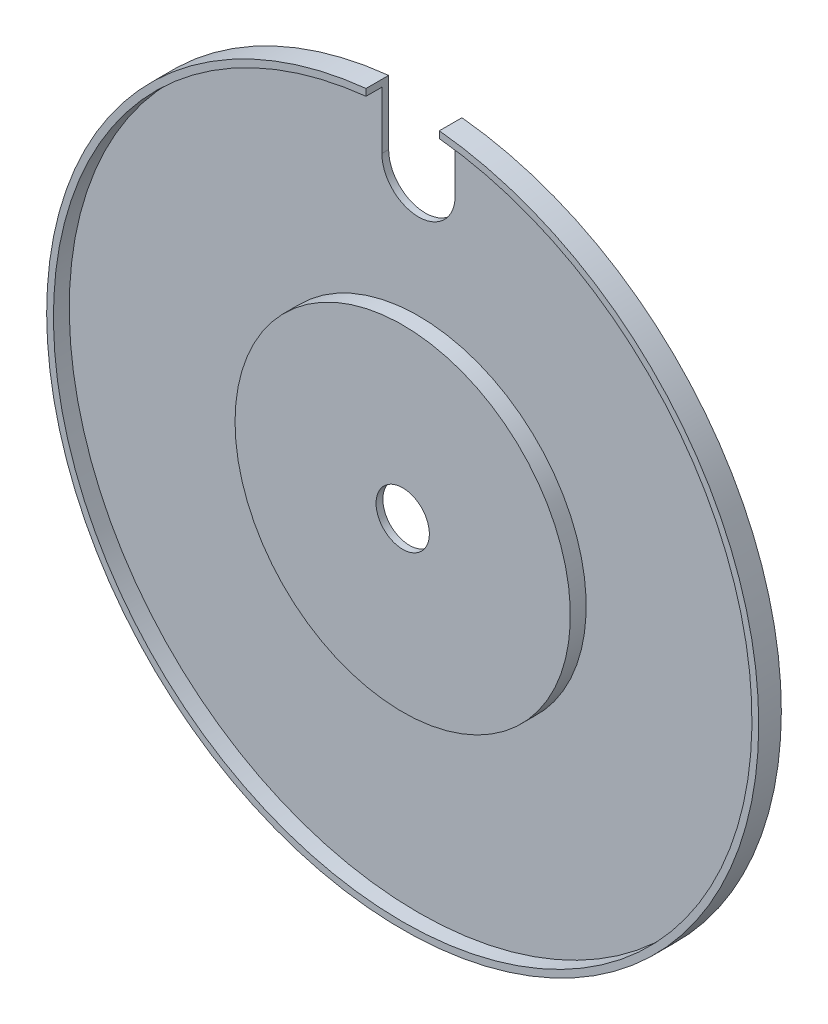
from build123d import *

# Parameters (mm, degrees)
SHELL1_T           = -0.762
SKETCH1_R          = 2.992510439
CUT_EXTRUDE5_DEPTH = 6.858


with BuildPart() as part:
    # Sketch2 → Revolve2 (revolve)
    with BuildSketch(Plane(origin=(0, 0, 0), x_dir=(1, 0, 0), z_dir=(0, 1, 0))):
        Polygon((-18.076962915, -1.173235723), (0, -1.173235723), (0, -1.935235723), (-18.076962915, -1.935235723), (-40.005, -1.935235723), (-40.005, 0.604764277), (-18.076962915, 0.604764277), align=None)
    revolve(axis=Axis((0, 0, 1.173235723), (0, 0, 1)))

    # Shell1
    shell1_openings = [part.faces().sort_by_distance(p)[0] for p in [
        (0, 0, 1.935235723),
    ]]
    offset(amount=SHELL1_T, openings=shell1_openings, kind=Kind.INTERSECTION)

    # Sketch1 → Cut-Extrude5 (cut, symmetric)
    with BuildSketch(Plane.XY):
        with Locations(Location((0, 0, 0), (0, 0, 180))):
            Circle(SKETCH1_R)
        with BuildLine():
            Line((-4.118543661, 32.577228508), (-4.118543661, 44.861647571))
            Line((-4.118543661, 44.861647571), (4.118543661, 44.861647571))
            Line((4.118543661, 44.861647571), (4.118543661, 32.577228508))
            ThreePointArc((4.118543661, 32.577228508), (0, 28.458684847), (-4.118543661, 32.577228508))
        make_face()
    extrude(amount=CUT_EXTRUDE5_DEPTH, both=True, mode=Mode.SUBTRACT)


solid = part.part
